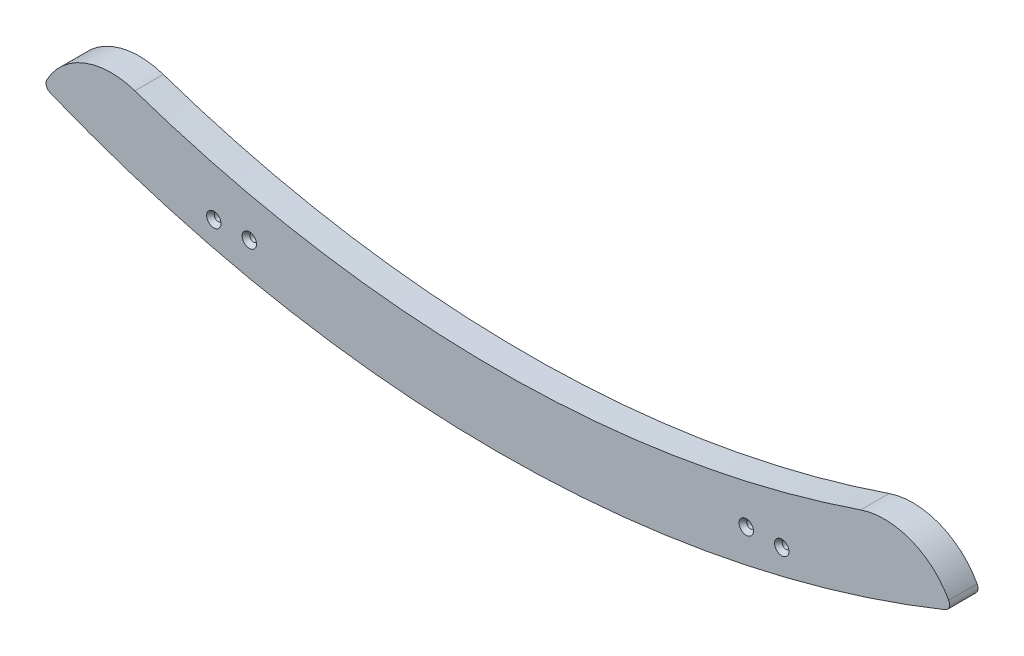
ISO-10303-21;
HEADER;
FILE_DESCRIPTION(('STEP AP214'),'2;1');
FILE_NAME('part.step','',(''),(''),'','','');
FILE_SCHEMA(('AUTOMOTIVE_DESIGN { 1 0 10303 214 1 1 1 1 }'));
ENDSEC;
DATA;
#1=APPLICATION_CONTEXT('core data for automotive mechanical design processes');
#2=APPLICATION_PROTOCOL_DEFINITION('international standard','automotive_design',2000,#1);
#3=PRODUCT_CONTEXT('',#1,'mechanical');
#4=PRODUCT('Part','Part','',(#3));
#5=PRODUCT_RELATED_PRODUCT_CATEGORY('part','',(#4));
#6=PRODUCT_DEFINITION_FORMATION('','',#4);
#7=PRODUCT_DEFINITION_CONTEXT('part definition',#1,'design');
#8=PRODUCT_DEFINITION('design','',#6,#7);
#9=PRODUCT_DEFINITION_SHAPE('','',#8);
#10=(LENGTH_UNIT() NAMED_UNIT(*) SI_UNIT(.MILLI.,.METRE.));
#11=(NAMED_UNIT(*) PLANE_ANGLE_UNIT() SI_UNIT($,.RADIAN.));
#12=(NAMED_UNIT(*) SI_UNIT($,.STERADIAN.) SOLID_ANGLE_UNIT());
#13=UNCERTAINTY_MEASURE_WITH_UNIT(LENGTH_MEASURE(1.E-05),#10,'distance_accuracy_value','');
#14=(GEOMETRIC_REPRESENTATION_CONTEXT(3) GLOBAL_UNCERTAINTY_ASSIGNED_CONTEXT((#13)) GLOBAL_UNIT_ASSIGNED_CONTEXT((#10,
#11,#12)) REPRESENTATION_CONTEXT('',''));
#15=CARTESIAN_POINT('',(0.,0.,0.));
#16=DIRECTION('',(0.,0.,1.));
#17=DIRECTION('',(1.,0.,0.));
#18=AXIS2_PLACEMENT_3D('',#15,#16,#17);
#19=CARTESIAN_POINT('',(-345.830272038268,27.8382618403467,12.7));
#20=DIRECTION('',(0.,0.,-1.));
#21=DIRECTION('',(-1.,0.,0.));
#22=AXIS2_PLACEMENT_3D('',#19,#20,#21);
#23=CYLINDRICAL_SURFACE('',#22,65.5094936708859);
#24=CARTESIAN_POINT('',(-345.830272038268,27.8382618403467,-12.7));
#25=DIRECTION('',(0.,0.,-1.));
#26=DIRECTION('',(-1.,0.,0.));
#27=AXIS2_PLACEMENT_3D('',#24,#25,#26);
#28=CIRCLE('',#27,65.5094936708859);
#29=CARTESIAN_POINT('',(-403.360117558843,59.1721194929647,-12.7));
#30=VERTEX_POINT('',#29);
#31=CARTESIAN_POINT('',(-324.633635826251,89.823714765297,-12.7));
#32=VERTEX_POINT('',#31);
#33=EDGE_CURVE('E114',#30,#32,#28,.T.);
#34=ORIENTED_EDGE('',*,*,#33,.F.);
#35=DIRECTION('',(0.,0.,-1.));
#36=VECTOR('',#35,1.);
#37=CARTESIAN_POINT('',(-403.360117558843,59.1721194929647,12.7));
#38=LINE('',#37,#36);
#39=CARTESIAN_POINT('',(-403.360117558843,59.1721194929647,12.7));
#40=VERTEX_POINT('',#39);
#41=EDGE_CURVE('E11',#30,#40,#38,.F.);
#42=ORIENTED_EDGE('',*,*,#41,.T.);
#43=CARTESIAN_POINT('',(-345.830272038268,27.8382618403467,12.7));
#44=DIRECTION('',(0.,0.,-1.));
#45=DIRECTION('',(-1.,0.,0.));
#46=AXIS2_PLACEMENT_3D('',#43,#44,#45);
#47=CIRCLE('',#46,65.5094936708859);
#48=CARTESIAN_POINT('',(-324.633635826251,89.823714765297,12.7));
#49=VERTEX_POINT('',#48);
#50=EDGE_CURVE('E87',#40,#49,#47,.T.);
#51=ORIENTED_EDGE('',*,*,#50,.T.);
#52=DIRECTION('',(0.,0.,-1.));
#53=VECTOR('',#52,1.);
#54=CARTESIAN_POINT('',(-324.633635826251,89.823714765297,12.7));
#55=LINE('',#54,#53);
#56=EDGE_CURVE('E89',#49,#32,#55,.T.);
#57=ORIENTED_EDGE('',*,*,#56,.T.);
#58=EDGE_LOOP('',(#34,#42,#51,#57));
#59=FACE_BOUND('',#58,.T.);
#60=ADVANCED_FACE('F35',(#59),#23,.T.);
#61=CARTESIAN_POINT('',(0.,1039.15184164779,12.7));
#62=DIRECTION('',(0.,0.,-1.));
#63=DIRECTION('',(-1.,0.,0.));
#64=AXIS2_PLACEMENT_3D('',#61,#62,#63);
#65=CYLINDRICAL_SURFACE('',#64,1066.8);
#66=CARTESIAN_POINT('',(0.,1039.15184164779,-12.7));
#67=DIRECTION('',(0.,0.,1.));
#68=DIRECTION('',(1.,0.,0.));
#69=AXIS2_PLACEMENT_3D('',#66,#67,#68);
#70=CIRCLE('',#69,1066.8);
#71=CARTESIAN_POINT('',(-400.165542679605,50.2485205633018,-12.7));
#72=VERTEX_POINT('',#71);
#73=CARTESIAN_POINT('',(400.165542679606,50.2485205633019,-12.7));
#74=VERTEX_POINT('',#73);
#75=EDGE_CURVE('E95',#72,#74,#70,.T.);
#76=ORIENTED_EDGE('',*,*,#75,.T.);
#77=DIRECTION('',(0.,0.,-1.));
#78=VECTOR('',#77,1.);
#79=CARTESIAN_POINT('',(400.165542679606,50.2485205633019,12.7));
#80=LINE('',#79,#78);
#81=CARTESIAN_POINT('',(400.165542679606,50.2485205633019,12.7));
#82=VERTEX_POINT('',#81);
#83=EDGE_CURVE('E56',#74,#82,#80,.F.);
#84=ORIENTED_EDGE('',*,*,#83,.T.);
#85=CARTESIAN_POINT('',(0.,1039.15184164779,12.7));
#86=DIRECTION('',(0.,0.,1.));
#87=DIRECTION('',(1.,0.,0.));
#88=AXIS2_PLACEMENT_3D('',#85,#86,#87);
#89=CIRCLE('',#88,1066.8);
#90=CARTESIAN_POINT('',(-400.165542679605,50.2485205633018,12.7));
#91=VERTEX_POINT('',#90);
#92=EDGE_CURVE('E103',#91,#82,#89,.T.);
#93=ORIENTED_EDGE('',*,*,#92,.F.);
#94=DIRECTION('',(0.,0.,-1.));
#95=VECTOR('',#94,1.);
#96=CARTESIAN_POINT('',(-400.165542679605,50.2485205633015,12.7));
#97=LINE('',#96,#95);
#98=EDGE_CURVE('E130',#91,#72,#97,.T.);
#99=ORIENTED_EDGE('',*,*,#98,.T.);
#100=EDGE_LOOP('',(#76,#84,#93,#99));
#101=FACE_BOUND('',#100,.T.);
#102=ADVANCED_FACE('F145',(#101),#65,.T.);
#103=CARTESIAN_POINT('',(345.830272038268,27.8382618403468,12.7));
#104=DIRECTION('',(0.,0.,-1.));
#105=DIRECTION('',(-1.,0.,0.));
#106=AXIS2_PLACEMENT_3D('',#103,#104,#105);
#107=CYLINDRICAL_SURFACE('',#106,65.5094936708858);
#108=CARTESIAN_POINT('',(345.830272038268,27.8382618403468,12.7));
#109=DIRECTION('',(0.,0.,-1.));
#110=DIRECTION('',(-1.,0.,0.));
#111=AXIS2_PLACEMENT_3D('',#108,#109,#110);
#112=CIRCLE('',#111,65.5094936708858);
#113=CARTESIAN_POINT('',(324.633635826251,89.8237147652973,12.7));
#114=VERTEX_POINT('',#113);
#115=CARTESIAN_POINT('',(403.360117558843,59.1721194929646,12.7));
#116=VERTEX_POINT('',#115);
#117=EDGE_CURVE('E108',#114,#116,#112,.T.);
#118=ORIENTED_EDGE('',*,*,#117,.T.);
#119=DIRECTION('',(0.,0.,-1.));
#120=VECTOR('',#119,1.);
#121=CARTESIAN_POINT('',(403.360117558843,59.1721194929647,12.7));
#122=LINE('',#121,#120);
#123=CARTESIAN_POINT('',(403.360117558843,59.1721194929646,-12.7));
#124=VERTEX_POINT('',#123);
#125=EDGE_CURVE('E122',#116,#124,#122,.T.);
#126=ORIENTED_EDGE('',*,*,#125,.T.);
#127=CARTESIAN_POINT('',(345.830272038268,27.8382618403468,-12.7));
#128=DIRECTION('',(0.,0.,-1.));
#129=DIRECTION('',(-1.,0.,0.));
#130=AXIS2_PLACEMENT_3D('',#127,#128,#129);
#131=CIRCLE('',#130,65.5094936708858);
#132=CARTESIAN_POINT('',(324.633635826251,89.8237147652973,-12.7));
#133=VERTEX_POINT('',#132);
#134=EDGE_CURVE('E118',#133,#124,#131,.T.);
#135=ORIENTED_EDGE('',*,*,#134,.F.);
#136=DIRECTION('',(0.,0.,-1.));
#137=VECTOR('',#136,1.);
#138=CARTESIAN_POINT('',(324.633635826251,89.8237147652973,12.7));
#139=LINE('',#138,#137);
#140=EDGE_CURVE('E102',#114,#133,#139,.T.);
#141=ORIENTED_EDGE('',*,*,#140,.F.);
#142=EDGE_LOOP('',(#118,#126,#135,#141));
#143=FACE_BOUND('',#142,.T.);
#144=ADVANCED_FACE('F139',(#143),#107,.T.);
#145=CARTESIAN_POINT('',(0.,1039.15184164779,12.7));
#146=DIRECTION('',(0.,0.,-1.));
#147=DIRECTION('',(-1.,0.,0.));
#148=AXIS2_PLACEMENT_3D('',#145,#146,#147);
#149=CYLINDRICAL_SURFACE('',#148,1003.3);
#150=CARTESIAN_POINT('',(0.,1039.15184164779,-12.7));
#151=DIRECTION('',(0.,0.,1.));
#152=DIRECTION('',(1.,0.,0.));
#153=AXIS2_PLACEMENT_3D('',#150,#151,#152);
#154=CIRCLE('',#153,1003.3);
#155=EDGE_CURVE('E101',#32,#133,#154,.T.);
#156=ORIENTED_EDGE('',*,*,#155,.F.);
#157=ORIENTED_EDGE('',*,*,#56,.F.);
#158=CARTESIAN_POINT('',(0.,1039.15184164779,12.7));
#159=DIRECTION('',(0.,0.,1.));
#160=DIRECTION('',(1.,0.,0.));
#161=AXIS2_PLACEMENT_3D('',#158,#159,#160);
#162=CIRCLE('',#161,1003.3);
#163=EDGE_CURVE('E94',#49,#114,#162,.T.);
#164=ORIENTED_EDGE('',*,*,#163,.T.);
#165=ORIENTED_EDGE('',*,*,#140,.T.);
#166=EDGE_LOOP('',(#156,#157,#164,#165));
#167=FACE_BOUND('',#166,.T.);
#168=ADVANCED_FACE('F99',(#167),#149,.F.);
#169=CARTESIAN_POINT('',(-172.915136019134,533.49505174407,12.7));
#170=DIRECTION('',(0.,0.,-1.));
#171=DIRECTION('',(-1.,0.,0.));
#172=AXIS2_PLACEMENT_3D('',#169,#170,#171);
#173=PLANE('',#172);
#174=CARTESIAN_POINT('',(-254.,25.4,12.7));
#175=DIRECTION('',(0.,0.,1.));
#176=DIRECTION('',(1.,0.,0.));
#177=AXIS2_PLACEMENT_3D('',#174,#175,#176);
#178=CIRCLE('',#177,6.4389);
#179=CARTESIAN_POINT('',(-247.5611,25.4,12.7));
#180=VERTEX_POINT('',#179);
#181=EDGE_CURVE('E208',#180,#180,#178,.T.);
#182=ORIENTED_EDGE('',*,*,#181,.F.);
#183=EDGE_LOOP('',(#182));
#184=FACE_BOUND('',#183,.T.);
#185=CARTESIAN_POINT('',(-222.25,25.4,12.7));
#186=DIRECTION('',(0.,0.,1.));
#187=DIRECTION('',(1.,0.,0.));
#188=AXIS2_PLACEMENT_3D('',#185,#186,#187);
#189=CIRCLE('',#188,6.4389);
#190=CARTESIAN_POINT('',(-215.8111,25.4,12.7));
#191=VERTEX_POINT('',#190);
#192=EDGE_CURVE('E215',#191,#191,#189,.T.);
#193=ORIENTED_EDGE('',*,*,#192,.F.);
#194=EDGE_LOOP('',(#193));
#195=FACE_BOUND('',#194,.T.);
#196=CARTESIAN_POINT('',(222.25,25.4,12.7));
#197=DIRECTION('',(0.,0.,1.));
#198=DIRECTION('',(1.,0.,0.));
#199=AXIS2_PLACEMENT_3D('',#196,#197,#198);
#200=CIRCLE('',#199,6.4389);
#201=CARTESIAN_POINT('',(228.6889,25.4,12.7));
#202=VERTEX_POINT('',#201);
#203=EDGE_CURVE('E224',#202,#202,#200,.T.);
#204=ORIENTED_EDGE('',*,*,#203,.F.);
#205=EDGE_LOOP('',(#204));
#206=FACE_BOUND('',#205,.T.);
#207=CARTESIAN_POINT('',(254.,25.4,12.7));
#208=DIRECTION('',(0.,0.,1.));
#209=DIRECTION('',(1.,0.,0.));
#210=AXIS2_PLACEMENT_3D('',#207,#208,#209);
#211=CIRCLE('',#210,6.43890000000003);
#212=CARTESIAN_POINT('',(260.4389,25.4,12.7));
#213=VERTEX_POINT('',#212);
#214=EDGE_CURVE('E233',#213,#213,#211,.T.);
#215=ORIENTED_EDGE('',*,*,#214,.F.);
#216=EDGE_LOOP('',(#215));
#217=FACE_BOUND('',#216,.T.);
#218=ORIENTED_EDGE('',*,*,#92,.T.);
#219=CARTESIAN_POINT('',(397.783604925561,56.1348498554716,12.7));
#220=DIRECTION('',(0.,0.,-1.));
#221=DIRECTION('',(-1.,0.,0.));
#222=AXIS2_PLACEMENT_3D('',#219,#220,#221);
#223=CIRCLE('',#222,6.35);
#224=EDGE_CURVE('E43',#82,#116,#223,.F.);
#225=ORIENTED_EDGE('',*,*,#224,.T.);
#226=ORIENTED_EDGE('',*,*,#117,.F.);
#227=ORIENTED_EDGE('',*,*,#163,.F.);
#228=ORIENTED_EDGE('',*,*,#50,.F.);
#229=CARTESIAN_POINT('',(-397.78360492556,56.1348498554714,12.7));
#230=DIRECTION('',(0.,0.,-1.));
#231=DIRECTION('',(-1.,0.,0.));
#232=AXIS2_PLACEMENT_3D('',#229,#230,#231);
#233=CIRCLE('',#232,6.35);
#234=EDGE_CURVE('E134',#40,#91,#233,.F.);
#235=ORIENTED_EDGE('',*,*,#234,.T.);
#236=EDGE_LOOP('',(#218,#225,#226,#227,#228,#235));
#237=FACE_BOUND('',#236,.T.);
#238=ADVANCED_FACE('F106',(#184,#195,#206,#217,#237),#173,.F.);
#239=CARTESIAN_POINT('',(-172.915136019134,533.49505174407,-12.7));
#240=DIRECTION('',(0.,0.,-1.));
#241=DIRECTION('',(-1.,0.,0.));
#242=AXIS2_PLACEMENT_3D('',#239,#240,#241);
#243=PLANE('',#242);
#244=CARTESIAN_POINT('',(-254.,25.4,-12.7));
#245=DIRECTION('',(0.,0.,1.));
#246=DIRECTION('',(1.,0.,0.));
#247=AXIS2_PLACEMENT_3D('',#244,#245,#246);
#248=CIRCLE('',#247,3.26389999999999);
#249=CARTESIAN_POINT('',(-250.7361,25.4,-12.7));
#250=VERTEX_POINT('',#249);
#251=EDGE_CURVE('E210',#250,#250,#248,.T.);
#252=ORIENTED_EDGE('',*,*,#251,.T.);
#253=EDGE_LOOP('',(#252));
#254=FACE_BOUND('',#253,.T.);
#255=CARTESIAN_POINT('',(-222.25,25.4,-12.7));
#256=DIRECTION('',(0.,0.,1.));
#257=DIRECTION('',(1.,0.,0.));
#258=AXIS2_PLACEMENT_3D('',#255,#256,#257);
#259=CIRCLE('',#258,3.26389999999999);
#260=CARTESIAN_POINT('',(-218.9861,25.4,-12.7));
#261=VERTEX_POINT('',#260);
#262=EDGE_CURVE('E221',#261,#261,#259,.T.);
#263=ORIENTED_EDGE('',*,*,#262,.T.);
#264=EDGE_LOOP('',(#263));
#265=FACE_BOUND('',#264,.T.);
#266=CARTESIAN_POINT('',(222.25,25.4,-12.7));
#267=DIRECTION('',(0.,0.,1.));
#268=DIRECTION('',(1.,0.,0.));
#269=AXIS2_PLACEMENT_3D('',#266,#267,#268);
#270=CIRCLE('',#269,3.26389999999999);
#271=CARTESIAN_POINT('',(225.5139,25.4,-12.7));
#272=VERTEX_POINT('',#271);
#273=EDGE_CURVE('E230',#272,#272,#270,.T.);
#274=ORIENTED_EDGE('',*,*,#273,.T.);
#275=EDGE_LOOP('',(#274));
#276=FACE_BOUND('',#275,.T.);
#277=CARTESIAN_POINT('',(254.,25.4,-12.7));
#278=DIRECTION('',(0.,0.,1.));
#279=DIRECTION('',(1.,0.,0.));
#280=AXIS2_PLACEMENT_3D('',#277,#278,#279);
#281=CIRCLE('',#280,3.26389999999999);
#282=CARTESIAN_POINT('',(257.2639,25.4,-12.7));
#283=VERTEX_POINT('',#282);
#284=EDGE_CURVE('E116',#283,#283,#281,.T.);
#285=ORIENTED_EDGE('',*,*,#284,.T.);
#286=EDGE_LOOP('',(#285));
#287=FACE_BOUND('',#286,.T.);
#288=ORIENTED_EDGE('',*,*,#134,.T.);
#289=CARTESIAN_POINT('',(397.783604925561,56.1348498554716,-12.7));
#290=DIRECTION('',(0.,0.,-1.));
#291=DIRECTION('',(-1.,0.,0.));
#292=AXIS2_PLACEMENT_3D('',#289,#290,#291);
#293=CIRCLE('',#292,6.35);
#294=EDGE_CURVE('E128',#124,#74,#293,.T.);
#295=ORIENTED_EDGE('',*,*,#294,.T.);
#296=ORIENTED_EDGE('',*,*,#75,.F.);
#297=CARTESIAN_POINT('',(-397.78360492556,56.1348498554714,-12.7));
#298=DIRECTION('',(0.,0.,-1.));
#299=DIRECTION('',(-1.,0.,0.));
#300=AXIS2_PLACEMENT_3D('',#297,#298,#299);
#301=CIRCLE('',#300,6.35);
#302=EDGE_CURVE('E126',#72,#30,#301,.T.);
#303=ORIENTED_EDGE('',*,*,#302,.T.);
#304=ORIENTED_EDGE('',*,*,#33,.T.);
#305=ORIENTED_EDGE('',*,*,#155,.T.);
#306=EDGE_LOOP('',(#288,#295,#296,#303,#304,#305));
#307=FACE_BOUND('',#306,.T.);
#308=ADVANCED_FACE('F144',(#254,#265,#276,#287,#307),#243,.T.);
#309=CARTESIAN_POINT('',(397.783604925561,56.1348498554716,12.7));
#310=DIRECTION('',(0.,0.,-1.));
#311=DIRECTION('',(-1.,0.,0.));
#312=AXIS2_PLACEMENT_3D('',#309,#310,#311);
#313=CYLINDRICAL_SURFACE('',#312,6.35);
#314=ORIENTED_EDGE('',*,*,#224,.F.);
#315=ORIENTED_EDGE('',*,*,#83,.F.);
#316=ORIENTED_EDGE('',*,*,#294,.F.);
#317=ORIENTED_EDGE('',*,*,#125,.F.);
#318=EDGE_LOOP('',(#314,#315,#316,#317));
#319=FACE_BOUND('',#318,.T.);
#320=ADVANCED_FACE('F141',(#319),#313,.T.);
#321=CARTESIAN_POINT('',(-397.78360492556,56.1348498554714,12.7));
#322=DIRECTION('',(0.,0.,-1.));
#323=DIRECTION('',(-1.,0.,0.));
#324=AXIS2_PLACEMENT_3D('',#321,#322,#323);
#325=CYLINDRICAL_SURFACE('',#324,6.35);
#326=ORIENTED_EDGE('',*,*,#234,.F.);
#327=ORIENTED_EDGE('',*,*,#41,.F.);
#328=ORIENTED_EDGE('',*,*,#302,.F.);
#329=ORIENTED_EDGE('',*,*,#98,.F.);
#330=EDGE_LOOP('',(#326,#327,#328,#329));
#331=FACE_BOUND('',#330,.T.);
#332=ADVANCED_FACE('F37',(#331),#325,.T.);
#333=CARTESIAN_POINT('',(254.,25.4,12.7));
#334=DIRECTION('',(0.,0.,1.));
#335=DIRECTION('',(1.,0.,0.));
#336=AXIS2_PLACEMENT_3D('',#333,#334,#335);
#337=CYLINDRICAL_SURFACE('',#336,3.26389999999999);
#338=ORIENTED_EDGE('',*,*,#284,.F.);
#339=EDGE_LOOP('',(#338));
#340=FACE_BOUND('',#339,.T.);
#341=CARTESIAN_POINT('',(254.,25.4,9.04758030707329));
#342=DIRECTION('',(0.,0.,1.));
#343=DIRECTION('',(1.,0.,0.));
#344=AXIS2_PLACEMENT_3D('',#341,#342,#343);
#345=CIRCLE('',#344,3.26389999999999);
#346=CARTESIAN_POINT('',(257.2639,25.4,9.04758030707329));
#347=VERTEX_POINT('',#346);
#348=EDGE_CURVE('E236',#347,#347,#345,.T.);
#349=ORIENTED_EDGE('',*,*,#348,.T.);
#350=EDGE_LOOP('',(#349));
#351=FACE_BOUND('',#350,.T.);
#352=ADVANCED_FACE('F149',(#340,#351),#337,.F.);
#353=CARTESIAN_POINT('',(254.,25.4,12.7));
#354=DIRECTION('',(0.,0.,1.));
#355=DIRECTION('',(1.,0.,0.));
#356=AXIS2_PLACEMENT_3D('',#353,#354,#355);
#357=CONICAL_SURFACE('',#356,6.43890000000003,0.715584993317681);
#358=ORIENTED_EDGE('',*,*,#348,.F.);
#359=EDGE_LOOP('',(#358));
#360=FACE_BOUND('',#359,.T.);
#361=ORIENTED_EDGE('',*,*,#214,.T.);
#362=EDGE_LOOP('',(#361));
#363=FACE_BOUND('',#362,.T.);
#364=ADVANCED_FACE('F154',(#360,#363),#357,.F.);
#365=CARTESIAN_POINT('',(222.25,25.4,12.7));
#366=DIRECTION('',(0.,0.,1.));
#367=DIRECTION('',(1.,0.,0.));
#368=AXIS2_PLACEMENT_3D('',#365,#366,#367);
#369=CYLINDRICAL_SURFACE('',#368,3.26389999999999);
#370=ORIENTED_EDGE('',*,*,#273,.F.);
#371=EDGE_LOOP('',(#370));
#372=FACE_BOUND('',#371,.T.);
#373=CARTESIAN_POINT('',(222.25,25.4,9.04758030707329));
#374=DIRECTION('',(0.,0.,1.));
#375=DIRECTION('',(1.,0.,0.));
#376=AXIS2_PLACEMENT_3D('',#373,#374,#375);
#377=CIRCLE('',#376,3.26389999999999);
#378=CARTESIAN_POINT('',(225.5139,25.4,9.04758030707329));
#379=VERTEX_POINT('',#378);
#380=EDGE_CURVE('E227',#379,#379,#377,.T.);
#381=ORIENTED_EDGE('',*,*,#380,.T.);
#382=EDGE_LOOP('',(#381));
#383=FACE_BOUND('',#382,.T.);
#384=ADVANCED_FACE('F176',(#372,#383),#369,.F.);
#385=CARTESIAN_POINT('',(222.25,25.4,12.7));
#386=DIRECTION('',(0.,0.,1.));
#387=DIRECTION('',(1.,0.,0.));
#388=AXIS2_PLACEMENT_3D('',#385,#386,#387);
#389=CONICAL_SURFACE('',#388,6.4389,0.715584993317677);
#390=ORIENTED_EDGE('',*,*,#380,.F.);
#391=EDGE_LOOP('',(#390));
#392=FACE_BOUND('',#391,.T.);
#393=ORIENTED_EDGE('',*,*,#203,.T.);
#394=EDGE_LOOP('',(#393));
#395=FACE_BOUND('',#394,.T.);
#396=ADVANCED_FACE('F180',(#392,#395),#389,.F.);
#397=CARTESIAN_POINT('',(-222.25,25.4,12.7));
#398=DIRECTION('',(0.,0.,1.));
#399=DIRECTION('',(1.,0.,0.));
#400=AXIS2_PLACEMENT_3D('',#397,#398,#399);
#401=CYLINDRICAL_SURFACE('',#400,3.26389999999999);
#402=ORIENTED_EDGE('',*,*,#262,.F.);
#403=EDGE_LOOP('',(#402));
#404=FACE_BOUND('',#403,.T.);
#405=CARTESIAN_POINT('',(-222.25,25.4,9.04758030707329));
#406=DIRECTION('',(0.,0.,1.));
#407=DIRECTION('',(1.,0.,0.));
#408=AXIS2_PLACEMENT_3D('',#405,#406,#407);
#409=CIRCLE('',#408,3.26389999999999);
#410=CARTESIAN_POINT('',(-218.9861,25.4,9.04758030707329));
#411=VERTEX_POINT('',#410);
#412=EDGE_CURVE('E218',#411,#411,#409,.T.);
#413=ORIENTED_EDGE('',*,*,#412,.T.);
#414=EDGE_LOOP('',(#413));
#415=FACE_BOUND('',#414,.T.);
#416=ADVANCED_FACE('F184',(#404,#415),#401,.F.);
#417=CARTESIAN_POINT('',(-222.25,25.4,12.7));
#418=DIRECTION('',(0.,0.,1.));
#419=DIRECTION('',(1.,0.,0.));
#420=AXIS2_PLACEMENT_3D('',#417,#418,#419);
#421=CONICAL_SURFACE('',#420,6.4389,0.715584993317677);
#422=ORIENTED_EDGE('',*,*,#412,.F.);
#423=EDGE_LOOP('',(#422));
#424=FACE_BOUND('',#423,.T.);
#425=ORIENTED_EDGE('',*,*,#192,.T.);
#426=EDGE_LOOP('',(#425));
#427=FACE_BOUND('',#426,.T.);
#428=ADVANCED_FACE('F188',(#424,#427),#421,.F.);
#429=CARTESIAN_POINT('',(-254.,25.4,12.7));
#430=DIRECTION('',(0.,0.,1.));
#431=DIRECTION('',(1.,0.,0.));
#432=AXIS2_PLACEMENT_3D('',#429,#430,#431);
#433=CYLINDRICAL_SURFACE('',#432,3.26389999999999);
#434=ORIENTED_EDGE('',*,*,#251,.F.);
#435=EDGE_LOOP('',(#434));
#436=FACE_BOUND('',#435,.T.);
#437=CARTESIAN_POINT('',(-254.,25.4,9.04758030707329));
#438=DIRECTION('',(0.,0.,1.));
#439=DIRECTION('',(1.,0.,0.));
#440=AXIS2_PLACEMENT_3D('',#437,#438,#439);
#441=CIRCLE('',#440,3.26389999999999);
#442=CARTESIAN_POINT('',(-250.7361,25.4,9.04758030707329));
#443=VERTEX_POINT('',#442);
#444=EDGE_CURVE('E205',#443,#443,#441,.T.);
#445=ORIENTED_EDGE('',*,*,#444,.T.);
#446=EDGE_LOOP('',(#445));
#447=FACE_BOUND('',#446,.T.);
#448=ADVANCED_FACE('F192',(#436,#447),#433,.F.);
#449=CARTESIAN_POINT('',(-254.,25.4,12.7));
#450=DIRECTION('',(0.,0.,1.));
#451=DIRECTION('',(1.,0.,0.));
#452=AXIS2_PLACEMENT_3D('',#449,#450,#451);
#453=CONICAL_SURFACE('',#452,6.4389,0.715584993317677);
#454=ORIENTED_EDGE('',*,*,#444,.F.);
#455=EDGE_LOOP('',(#454));
#456=FACE_BOUND('',#455,.T.);
#457=ORIENTED_EDGE('',*,*,#181,.T.);
#458=EDGE_LOOP('',(#457));
#459=FACE_BOUND('',#458,.T.);
#460=ADVANCED_FACE('F196',(#456,#459),#453,.F.);
#461=CLOSED_SHELL('',(#60,#102,#144,#168,#238,#308,#320,#332,#352,#364,#384,#396,#416,#428,#448,#460));
#462=MANIFOLD_SOLID_BREP('B2',#461);
#463=ADVANCED_BREP_SHAPE_REPRESENTATION('',(#18,#462),#14);
#464=SHAPE_DEFINITION_REPRESENTATION(#9,#463);
ENDSEC;
END-ISO-10303-21;
